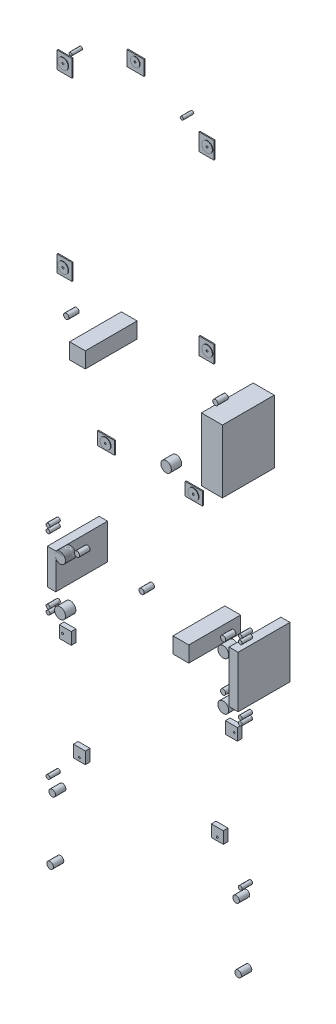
from build123d import *

# Parameters (mm, degrees)
ESQUISSE2_R                = 52.520227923
A_B_C_DEPTH                = 100
A_B_C_2_DEPTH              = 100
A_B_C_3_DEPTH              = 100
A_B_C_4_DEPTH              = 100
ESQUISSE2_R_2              = 31.747741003
A_B_C_5_DEPTH              = 100
A_B_C_6_DEPTH              = 100
A_B_C_7_DEPTH              = 100
A_B_C_8_DEPTH              = 100
ESQUISSE2_R_3              = 25.398192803
A_B_C_9_DEPTH              = 100
A_B_C_10_DEPTH             = 100
A_B_C_11_DEPTH             = 100
A_B_C_12_DEPTH             = 100
ESQUISSE2_W                = 114.991827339
ESQUISSE2_H                = 114.991827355
A_B_C_13_DEPTH             = 100
ESQUISSE2_W_2              = 114.991827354
ESQUISSE2_H_2              = 114.051773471
A_B_C_14_DEPTH             = 100
ESQUISSE2_H_3              = 114.991827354
A_B_C_15_DEPTH             = 100
A_B_C_16_DEPTH             = 100
ESQUISSE3_R                = 18.887018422
EXTRUDE_D_DEPTH            = 100
EXTRUDE_D_2_DEPTH          = 100
EXTRUDE_D_3_DEPTH          = 100
EXTRUDE_D_4_DEPTH          = 100
EXTRUDE_D_5_DEPTH          = 100
EXTRUDE_D_6_DEPTH          = 100
EXTRUDE_D_7_DEPTH          = 100
EXTRUDE_D_8_DEPTH          = 100
EXTRUDE_D_9_DEPTH          = 100
EXTRUDE_D_10_DEPTH         = 100
ESQUISSE4_R                = 50.796385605
BOSS_EXTRU_3_DEPTH         = 100
BOSS_EXTRU_3_2_DEPTH       = 100
BOSS_EXTRU_3_3_DEPTH       = 100
BOSS_EXTRU_3_4_DEPTH       = 100
BOSS_EXTRU_3_5_DEPTH       = 100
BOSS_EXTRU_3_6_DEPTH       = 100
BOSS_EXTRU_3_7_DEPTH       = 100
ESQUISSE4_R_2              = 25.398192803
BOSS_EXTRU_3_8_DEPTH       = 100
BOSS_EXTRU_3_9_DEPTH       = 100
ESQUISSE4_R_3              = 15.238915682
BOSS_EXTRU_3_10_DEPTH      = 100
BOSS_EXTRU_3_11_DEPTH      = 100
ESQUISSE4_R_4              = 44.192855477
BOSS_EXTRU_3_12_DEPTH      = 100
ESQUISSE5_W                = 87.166241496
ESQUISSE5_H                = 497.485958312
ESQUISSE5_W_2              = 152.389156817
ESQUISSE5_H_2              = 152.389348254
ESQUISSE5_W_3              = 81.375767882
ESQUISSE5_H_3              = 341.064857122
ESQUISSE5_W_4              = 203.185542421
ESQUISSE5_H_4              = 609.556627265
ESQUISSE5_W_5              = 151.810565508
ESQUISSE5_H_5              = 151.810565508
BOSS_EXTRU_4_DEPTH         = 500
ESQUISSE6_W                = 1904.864431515
ESQUISSE6_H                = 2919.792319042
BOSS_EXTRU_5_DEPTH         = 2000
ESQUISSE6_W_2              = 1225.71678466
ESQUISSE6_H_2              = 2212.817547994
BOSS_EXTRU_5_2_DEPTH       = 2000
ESQUISSE6_W_3              = 1656.343343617
ESQUISSE6_H_3              = 966.772209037
BOSS_EXTRU_5_3_DEPTH       = 2000
ESQUISSE7_W                = 142.864834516
ESQUISSE7_H                = 165.088253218
ESQUISSE7_R                = 50.796385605
BOSS_EXTRU_6_DEPTH         = 10
ESQUISSE7_W_2              = 142.864834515
BOSS_EXTRU_6_2_DEPTH       = 10
ESQUISSE7_W_3              = 165.088253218
ESQUISSE7_H_2              = 142.864834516
ESQUISSE7_R_2              = 44.192855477
BOSS_EXTRU_6_3_DEPTH       = 10
BOSS_EXTRU_6_4_DEPTH       = 10
ESQUISSE7_H_3              = 158.738705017
BOSS_EXTRU_6_5_DEPTH       = 10
ESQUISSE7_W_4              = 165.088253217
ESQUISSE7_H_4              = 123.816240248
BOSS_EXTRU_6_6_DEPTH       = 10
BOSS_EXTRU_6_7_DEPTH       = 10
ESQUISSE8_R                = 50.796385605
ESQUISSE8_R_2              = 44.192855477
ENL_V_MAT_EXTRU_1_DEPTH    = 85
D_GAGEMENT_M161_AT_2_COUNT = 2
D_GAGEMENT_M161_AT_2_PITCH = 848.299639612
D_GAGEMENT_M161_AT_3_COUNT = 2
D_GAGEMENT_M161_AT_3_PITCH = 1328.031486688
D_GAGEMENT_M161_AT_4_COUNT = 2
D_GAGEMENT_M161_AT_4_PITCH = 1600.312306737
D_GAGEMENT_M161_AT_5_COUNT = 2
D_GAGEMENT_M161_AT_5_PITCH = 3126.642890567
D_GAGEMENT_M161_AT_6_COUNT = 2
D_GAGEMENT_M161_AT_6_PITCH = 3342.651071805
D_GAGEMENT_M161_AT_7_COUNT = 2
D_GAGEMENT_M161_AT_7_PITCH = 2996.425189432
ESQUISSE11_W               = 54.709029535
ESQUISSE11_H               = 1140.180950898
ENL_V_MAT_EXTRU_2_DEPTH    = 69022.726003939
ESQUISSE13_W               = 9
ESQUISSE13_H               = 445.290970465
D_GAGEMENT_M162_AT_2_COUNT = 2
D_GAGEMENT_M162_AT_2_PITCH = 1656.638800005
D_GAGEMENT_M162_AT_3_COUNT = 2
D_GAGEMENT_M162_AT_3_PITCH = 1774.30579041
D_GAGEMENT_M162_AT_4_COUNT = 2
D_GAGEMENT_M162_AT_4_PITCH = 970.729277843
ESQUISSE14_R               = 52.520227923
BOSS_EXTRU_7_DEPTH         = 100


with BuildPart() as part:
    # Esquisse2 → a-b-c (new body)
    with BuildSketch(Plane.XY):
        with Locations((32095.371211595, 64025.247249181)):
            Circle(ESQUISSE2_R)
    extrude(amount=-A_B_C_DEPTH)


with BuildPart() as body_2:
    # Esquisse2 → a-b-c 2 (new body)
    with BuildSketch(Plane.XY):
        with Locations((32095.371211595, 64488.510285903)):
            Circle(ESQUISSE2_R)
    extrude(amount=-A_B_C_2_DEPTH)


with BuildPart() as body_3:
    # Esquisse2 → a-b-c 3 (new body)
    with BuildSketch(Plane.XY):
        with Locations((30520.683215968, 64487.995774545)):
            Circle(ESQUISSE2_R)
    extrude(amount=-A_B_C_3_DEPTH)

    # Esquisse5 → Boss.-Extru.4 (add)
    with BuildSketch(Plane.XY):
        with Locations((32195.303488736, 64308.074603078)):
            Rectangle(ESQUISSE5_W, ESQUISSE5_H)
        with Locations((31686.573008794, 64303.822582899)):
            Rectangle(ESQUISSE5_W_2, ESQUISSE5_H_2)
        with Locations((30438.71352094, 64352.316214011)):
            Rectangle(ESQUISSE5_W_3, ESQUISSE5_H_3)
        with Locations((31986.029536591, 66075.057217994)):
            Rectangle(ESQUISSE5_W_4, ESQUISSE5_H_4)
        with Locations((30688.555630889, 66262.431988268)):
            Rectangle(ESQUISSE5_W_5, ESQUISSE5_H_5)
    extrude(amount=-BOSS_EXTRU_4_DEPTH)


with BuildPart() as body_4:
    # Esquisse2 → a-b-c 4 (new body)
    with BuildSketch(Plane.XY):
        with Locations((30520.683215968, 64025.106415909)):
            Circle(ESQUISSE2_R)
    extrude(amount=-A_B_C_4_DEPTH)


with BuildPart() as body_5:
    # Esquisse2 → a-b-c 5 (new body)
    with BuildSketch(Plane.XY):
        with Locations((32239.044655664, 61870.558041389)):
            Circle(ESQUISSE2_R_2)
    extrude(amount=-A_B_C_5_DEPTH)


with BuildPart() as body_6:
    # Esquisse2 → a-b-c 6 (new body)
    with BuildSketch(Plane.XY):
        with Locations((32219.041079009, 62483.614419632)):
            Circle(ESQUISSE2_R_2)
    extrude(amount=-A_B_C_6_DEPTH)


with BuildPart() as body_7:
    # Esquisse2 → a-b-c 7 (new body)
    with BuildSketch(Plane.XY):
        with Locations((30444.977311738, 62483.614419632)):
            Circle(ESQUISSE2_R_2)
    extrude(amount=-A_B_C_7_DEPTH)


with BuildPart() as body_8:
    # Esquisse2 → a-b-c 8 (new body)
    with BuildSketch(Plane.XY):
        with Locations((30424.978734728, 61870.558041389)):
            Circle(ESQUISSE2_R_2)
    extrude(amount=-A_B_C_8_DEPTH)


with BuildPart() as body_9:
    # Esquisse2 → a-b-c 9 (new body)
    with BuildSketch(Plane.XY):
        with Locations((30684.543072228, 64599.657659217)):
            Circle(ESQUISSE2_R_3)
    extrude(amount=-A_B_C_9_DEPTH)


with BuildPart() as body_10:
    # Esquisse2 → a-b-c 10 (new body)
    with BuildSketch(Plane.XY):
        with Locations((31306.798792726, 64599.657659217)):
            Circle(ESQUISSE2_R_3)
    extrude(amount=-A_B_C_10_DEPTH)


with BuildPart() as body_11:
    # Esquisse2 → a-b-c 11 (new body)
    with BuildSketch(Plane.XY):
        with Locations((32094.142765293, 64599.657659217)):
            Circle(ESQUISSE2_R_3)
    extrude(amount=-A_B_C_11_DEPTH)


with BuildPart() as body_12:
    # Esquisse2 → a-b-c 12 (new body)
    with BuildSketch(Plane.XY):
        with Locations((32094.142765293, 64152.649465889)):
            Circle(ESQUISSE2_R_3)
    extrude(amount=-A_B_C_12_DEPTH)


with BuildPart() as body_13:
    # Esquisse2 → a-b-c 13 (new body)
    with BuildSketch(Plane.XY):
        with Locations((32119.210545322, 63812.294969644)):
            Rectangle(ESQUISSE2_W, ESQUISSE2_H)
    extrude(amount=-A_B_C_13_DEPTH)


with BuildPart() as body_14:
    # Esquisse2 → a-b-c 14 (new body)
    with BuildSketch(Plane.XY):
        with Locations((31983.544869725, 62882.010720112)):
            Rectangle(ESQUISSE2_W_2, ESQUISSE2_H_2)
    extrude(amount=-A_B_C_14_DEPTH)


with BuildPart() as body_15:
    # Esquisse2 → a-b-c 15 (new body)
    with BuildSketch(Plane.XY):
        with Locations((30652.351449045, 62882.339913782)):
            Rectangle(ESQUISSE2_W_2, ESQUISSE2_H_3)
    extrude(amount=-A_B_C_15_DEPTH)


with BuildPart() as body_16:
    # Esquisse2 → a-b-c 16 (new body)
    with BuildSketch(Plane.XY):
        with Locations((30516.685731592, 63812.294969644)):
            Rectangle(ESQUISSE2_W, ESQUISSE2_H)
    extrude(amount=-A_B_C_16_DEPTH)


with BuildPart() as body_17:
    # Esquisse3 → Extrude d (new body)
    with BuildSketch(Plane.XY):
        with Locations((32259.44820394, 64649.960274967)):
            Circle(ESQUISSE3_R)
    extrude(amount=-EXTRUDE_D_DEPTH)


with BuildPart() as body_18:
    # Esquisse3 → Extrude d 2 (new body)
    with BuildSketch(Plane.XY):
        with Locations((32259.44820439, 64699.956719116)):
            Circle(ESQUISSE3_R)
    extrude(amount=-EXTRUDE_D_2_DEPTH)


with BuildPart() as body_19:
    # Esquisse3 → Extrude d 3 (new body)
    with BuildSketch(Plane.XY):
        with Locations((30404.580098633, 64699.956718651)):
            Circle(ESQUISSE3_R)
    extrude(amount=-EXTRUDE_D_3_DEPTH)


with BuildPart() as body_20:
    # Esquisse3 → Extrude d 4 (new body)
    with BuildSketch(Plane.XY):
        with Locations((30404.58018626, 64649.960274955)):
            Circle(ESQUISSE3_R)
    extrude(amount=-EXTRUDE_D_4_DEPTH)


with BuildPart() as body_21:
    # Esquisse3 → Extrude d 5 (new body)
    with BuildSketch(Plane.XY):
        with Locations((30404.58018626, 64020.005099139)):
            Circle(ESQUISSE3_R)
    extrude(amount=-EXTRUDE_D_5_DEPTH)


with BuildPart() as body_22:
    # Esquisse3 → Extrude d 6 (new body)
    with BuildSketch(Plane.XY):
        with Locations((30404.58018626, 63970.008656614)):
            Circle(ESQUISSE3_R)
    extrude(amount=-EXTRUDE_D_6_DEPTH)


with BuildPart() as body_23:
    # Esquisse3 → Extrude d 7 (new body)
    with BuildSketch(Plane.XY):
        with Locations((32259.44820394, 64020.005099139)):
            Circle(ESQUISSE3_R)
    extrude(amount=-EXTRUDE_D_7_DEPTH)


with BuildPart() as body_24:
    # Esquisse3 → Extrude d 8 (new body)
    with BuildSketch(Plane.XY):
        with Locations((32259.44820394, 63970.008656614)):
            Circle(ESQUISSE3_R)
    extrude(amount=-EXTRUDE_D_8_DEPTH)


with BuildPart() as body_25:
    # Esquisse3 → Extrude d 9 (new body)
    with BuildSketch(Plane.XY):
        with Locations((32259.44820394, 62597.606309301)):
            Circle(ESQUISSE3_R)
    extrude(amount=-EXTRUDE_D_9_DEPTH)


with BuildPart() as body_26:
    # Esquisse3 → Extrude d 10 (new body)
    with BuildSketch(Plane.XY):
        with Locations((30404.58018626, 62597.606309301)):
            Circle(ESQUISSE3_R)
    extrude(amount=-EXTRUDE_D_10_DEPTH)


with BuildPart() as body_27:
    # Esquisse4 → Boss.-Extru.3 (new body)
    with BuildSketch(Plane.XY):
        with Locations((30872.340726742, 65575.783477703)):
            Circle(ESQUISSE4_R)
    extrude(amount=-BOSS_EXTRU_3_DEPTH)


with BuildPart() as body_28:
    # Esquisse4 → Boss.-Extru.3 2 (new body)
    with BuildSketch(Plane.XY):
        with Locations((31720.640366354, 65575.783477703)):
            Circle(ESQUISSE4_R)
    extrude(amount=-BOSS_EXTRU_3_2_DEPTH)


with BuildPart() as body_29:
    # Esquisse4 → Boss.-Extru.3 3 (new body)
    with BuildSketch(Plane.XY):
        with Locations((31543.259387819, 65759.920375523)):
            Circle(ESQUISSE4_R)
    extrude(amount=-BOSS_EXTRU_3_3_DEPTH)


with BuildPart() as body_30:
    # Esquisse4 → Boss.-Extru.3 4 (new body)
    with BuildSketch(Plane.XY):
        with Locations((30463.582211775, 66839.343569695)):
            Circle(ESQUISSE4_R)
    extrude(amount=-BOSS_EXTRU_3_4_DEPTH)


with BuildPart() as body_31:
    # Esquisse4 → Boss.-Extru.3 5 (new body)
    with BuildSketch(Plane.XY):
        with Locations((31854.387249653, 66839.343569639)):
            Circle(ESQUISSE4_R)
    extrude(amount=-BOSS_EXTRU_3_5_DEPTH)


with BuildPart() as body_32:
    # Esquisse4 → Boss.-Extru.3 6 (new body)
    with BuildSketch(Plane.XY):
        with Locations((30463.582211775, 68544.197261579)):
            Circle(ESQUISSE4_R)
    extrude(amount=-BOSS_EXTRU_3_6_DEPTH)


with BuildPart() as body_33:
    # Esquisse4 → Boss.-Extru.3 7 (new body)
    with BuildSketch(Plane.XY):
        with Locations((31854.387249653, 68544.197261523)):
            Circle(ESQUISSE4_R)
    extrude(amount=-BOSS_EXTRU_3_7_DEPTH)


with BuildPart() as body_34:
    # Esquisse4 → Boss.-Extru.3 8 (new body)
    with BuildSketch(Plane.XY):
        with Locations((32019.069131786, 66534.565256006)):
            Circle(ESQUISSE4_R_2)
    extrude(amount=-BOSS_EXTRU_3_8_DEPTH)


with BuildPart() as body_35:
    # Esquisse4 → Boss.-Extru.3 9 (new body)
    with BuildSketch(Plane.XY):
        with Locations((30580.261509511, 66534.565256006)):
            Circle(ESQUISSE4_R_2)
    extrude(amount=-BOSS_EXTRU_3_9_DEPTH)


with BuildPart() as body_36:
    # Esquisse4 → Boss.-Extru.3 10 (new body)
    with BuildSketch(Plane.XY):
        with Locations((31695.648544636, 68747.382804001)):
            Circle(ESQUISSE4_R_3)
    extrude(amount=-BOSS_EXTRU_3_10_DEPTH)


with BuildPart() as body_37:
    # Esquisse4 → Boss.-Extru.3 11 (new body)
    with BuildSketch(Plane.XY):
        with Locations((30622.320916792, 68747.382804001)):
            Circle(ESQUISSE4_R_3)
    extrude(amount=-BOSS_EXTRU_3_11_DEPTH)


with BuildPart() as body_38:
    # Esquisse4 → Boss.-Extru.3 12 (new body)
    with BuildSketch(Plane.XY):
        with Locations((31158.984730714, 68906.121509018)):
            Circle(ESQUISSE4_R_4)
    extrude(amount=-BOSS_EXTRU_3_12_DEPTH)


with BuildPart() as boss_extru_4_piece_1:
    # of the separate pieces the step leaves, piece 1, a body of its own (boss_extru_4_pieces)
    add(body_3.part.solids().sort_by_distance((31884.43676538, 66379.835531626, 0))[0])


with BuildPart() as boss_extru_4_piece_2:
    # of the separate pieces the step leaves, piece 2, a body of its own (boss_extru_4_pieces)
    add(body_3.part.solids().sort_by_distance((32151.720367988, 64556.817582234, 0))[0])


with BuildPart() as boss_extru_4_piece_3:
    # of the separate pieces the step leaves, piece 3, a body of its own (boss_extru_4_pieces)
    add(body_3.part.solids().sort_by_distance((30479.401404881, 64520.464011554, 0))[0])


with BuildPart() as boss_extru_4_piece_4:
    # of the separate pieces the step leaves, piece 4, a body of its own (boss_extru_4_pieces)
    add(body_3.part.solids().sort_by_distance((31762.767587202, 64227.627908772, 0))[0])


with BuildPart() as boss_extru_4_piece_5:
    # of the separate pieces the step leaves, piece 5, a body of its own (boss_extru_4_pieces)
    add(body_3.part.solids().sort_by_distance((30612.650348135, 66338.337271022, 0))[0])


with BuildPart() as body_43:
    # Esquisse6 → Boss.-Extru.5 (new body)
    with BuildSketch(Plane.XY):
        with Locations((31332.014180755, 63265.058854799)):
            Rectangle(ESQUISSE6_W, ESQUISSE6_H)
    extrude(amount=BOSS_EXTRU_5_DEPTH)


with BuildPart() as body_44:
    # Esquisse6 → Boss.-Extru.5 2 (new body)
    with BuildSketch(Plane.XY):
        with Locations((31158.984730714, 67717.168608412)):
            Rectangle(ESQUISSE6_W_2, ESQUISSE6_H_2)
    extrude(amount=BOSS_EXTRU_5_2_DEPTH)


with BuildPart() as body_45:
    # Esquisse6 → Boss.-Extru.5 3 (new body)
    with BuildSketch(Plane.XY):
        with Locations((31311.538875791, 66127.363729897)):
            Rectangle(ESQUISSE6_W_3, ESQUISSE6_H_3)
    extrude(amount=BOSS_EXTRU_5_3_DEPTH)


with BuildPart() as body_46:
    # Esquisse7 → Boss.-Extru.6 (new body)
    with BuildSketch(Plane(origin=(0, 0, -100), x_dir=(-1, 0, 0), z_dir=(0, 0, -1))):
        with Locations((-30474.693921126, 68544.197261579)):
            Rectangle(ESQUISSE7_W, ESQUISSE7_H)
        with Locations((-30463.582211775, 68544.197261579)):
            Circle(ESQUISSE7_R, mode=Mode.SUBTRACT)
    extrude(amount=-BOSS_EXTRU_6_DEPTH)


with BuildPart() as body_47:
    # Esquisse7 → Boss.-Extru.6 2 (new body)
    with BuildSketch(Plane(origin=(0, 0, -100), x_dir=(-1, 0, 0), z_dir=(0, 0, -1))):
        with Locations((-31843.275540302, 68544.197261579)):
            Rectangle(ESQUISSE7_W_2, ESQUISSE7_H)
        with Locations((-31854.387249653, 68544.197261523)):
            Circle(ESQUISSE7_R, mode=Mode.SUBTRACT)
    extrude(amount=-BOSS_EXTRU_6_2_DEPTH)


with BuildPart() as body_48:
    # Esquisse7 → Boss.-Extru.6 3 (new body)
    with BuildSketch(Plane(origin=(0, 0, -100), x_dir=(-1, 0, 0), z_dir=(0, 0, -1))):
        with Locations((-31158.984730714, 68895.009799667)):
            Rectangle(ESQUISSE7_W_3, ESQUISSE7_H_2)
        with Locations((-31158.984730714, 68906.121509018)):
            Circle(ESQUISSE7_R_2, mode=Mode.SUBTRACT)
    extrude(amount=-BOSS_EXTRU_6_3_DEPTH)


with BuildPart() as body_49:
    # Esquisse7 → Boss.-Extru.6 4 (new body)
    with BuildSketch(Plane(origin=(0, 0, -100), x_dir=(-1, 0, 0), z_dir=(0, 0, -1))):
        with Locations((-31843.275540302, 66839.343569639)):
            Rectangle(ESQUISSE7_W_2, ESQUISSE7_H)
        with Locations((-31854.387249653, 66839.343569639)):
            Circle(ESQUISSE7_R, mode=Mode.SUBTRACT)
    extrude(amount=-BOSS_EXTRU_6_4_DEPTH)


with BuildPart() as body_50:
    # Esquisse7 → Boss.-Extru.6 5 (new body)
    with BuildSketch(Plane(origin=(0, 0, -100), x_dir=(-1, 0, 0), z_dir=(0, 0, -1))):
        with Locations((-30474.693921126, 66842.518343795)):
            Rectangle(ESQUISSE7_W, ESQUISSE7_H_3)
        with Locations((-30463.582211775, 66839.343569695)):
            Circle(ESQUISSE7_R, mode=Mode.SUBTRACT)
    extrude(amount=-BOSS_EXTRU_6_5_DEPTH)


with BuildPart() as body_51:
    # Esquisse7 → Boss.-Extru.6 6 (new body)
    with BuildSketch(Plane(origin=(0, 0, -100), x_dir=(-1, 0, 0), z_dir=(0, 0, -1))):
        with Locations((-31720.640366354, 65577.37088992)):
            Rectangle(ESQUISSE7_W_4, ESQUISSE7_H_4)
        with Locations((-31720.640366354, 65575.783477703)):
            Circle(ESQUISSE7_R, mode=Mode.SUBTRACT)
    extrude(amount=-BOSS_EXTRU_6_6_DEPTH)


with BuildPart() as body_52:
    # Esquisse7 → Boss.-Extru.6 7 (new body)
    with BuildSketch(Plane(origin=(0, 0, -100), x_dir=(-1, 0, 0), z_dir=(0, 0, -1))):
        with Locations((-30872.340726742, 65577.37088992)):
            Rectangle(ESQUISSE7_W_3, ESQUISSE7_H_4)
        with Locations((-30872.340726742, 65575.783477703)):
            Circle(ESQUISSE7_R, mode=Mode.SUBTRACT)
    extrude(amount=-BOSS_EXTRU_6_7_DEPTH)


with BuildPart() as enl_v_mat_extru_1_tool:
    # Esquisse8 → Enl_v. mat.-Extru.1 (new body)
    with BuildSketch(Plane.XY):
        with Locations(Location((31854.387249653, 68544.197261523, 0), (0, 0, 180))):
            Circle(ESQUISSE8_R)
        with Locations(Location((30463.582211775, 68544.197261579, 0), (0, 0, 180))):
            Circle(ESQUISSE8_R)
        with Locations(Location((31158.984730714, 68906.121509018, 0), (0, 0, 180))):
            Circle(ESQUISSE8_R_2)
        with Locations(Location((30872.340726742, 65575.783477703, 0), (0, 0, 180))):
            Circle(ESQUISSE8_R)
        with Locations(Location((31720.640366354, 65575.783477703, 0), (0, 0, 180))):
            Circle(ESQUISSE8_R)
        with Locations(Location((31854.387249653, 66839.343569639, 0), (0, 0, 180))):
            Circle(ESQUISSE8_R)
        with Locations(Location((30463.582211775, 66839.343569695, 0), (0, 0, 180))):
            Circle(ESQUISSE8_R)
    extrude(amount=-ENL_V_MAT_EXTRU_1_DEPTH)


with BuildPart() as body_27_1:
    add(body_27.part)

    # Enl_v. mat.-Extru.1: cut by enl_v_mat_extru_1_tool
    add(enl_v_mat_extru_1_tool.part, mode=Mode.SUBTRACT)

    # Esquisse10 → D_gagement M161 (revolve, cut)
    with BuildSketch(Plane(origin=(30872.340726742, 65575.783477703, -85), x_dir=(0, -1, 0), z_dir=(1, 0, 0))):
        Polygon((0, 0), (0, 38.157745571), (9, 32.75), (9, 0), align=None)
    d_gagement_m161 = revolve(axis=Axis((30872.340726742, 65575.783477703, -78.65), (0, 0, -1)), mode=Mode.SUBTRACT)


with BuildPart() as body_28_1:
    add(body_28.part)

    # Enl_v. mat.-Extru.1: cut by enl_v_mat_extru_1_tool
    add(enl_v_mat_extru_1_tool.part, mode=Mode.SUBTRACT)

    # D_gagement M161 at 2: D_gagement M161 ×2
    with Locations(*[(i * D_GAGEMENT_M161_AT_2_PITCH, 0, 0) for i in range(1, D_GAGEMENT_M161_AT_2_COUNT)]):
        add(d_gagement_m161, mode=Mode.SUBTRACT)


with BuildPart() as body_30_1:
    add(body_30.part)

    # Enl_v. mat.-Extru.1: cut by enl_v_mat_extru_1_tool
    add(enl_v_mat_extru_1_tool.part, mode=Mode.SUBTRACT)

    # D_gagement M161 at 3: D_gagement M161 ×2
    with Locations(*[Vector(-0.3077927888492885, 0.9514534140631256, 0) * (i * D_GAGEMENT_M161_AT_3_PITCH) for i in range(1, D_GAGEMENT_M161_AT_3_COUNT)]):
        add(d_gagement_m161, mode=Mode.SUBTRACT)


with BuildPart() as body_31_1:
    add(body_31.part)

    # Enl_v. mat.-Extru.1: cut by enl_v_mat_extru_1_tool
    add(enl_v_mat_extru_1_tool.part, mode=Mode.SUBTRACT)

    # D_gagement M161 at 4: D_gagement M161 ×2
    with Locations(*[Vector(0.6136592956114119, 0.789570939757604, 0) * (i * D_GAGEMENT_M161_AT_4_PITCH) for i in range(1, D_GAGEMENT_M161_AT_4_COUNT)]):
        add(d_gagement_m161, mode=Mode.SUBTRACT)


with BuildPart() as body_32_1:
    add(body_32.part)

    # Enl_v. mat.-Extru.1: cut by enl_v_mat_extru_1_tool
    add(enl_v_mat_extru_1_tool.part, mode=Mode.SUBTRACT)

    # D_gagement M161 at 7: D_gagement M161 ×2
    with Locations(*[Vector(-0.13641539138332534, 0.9906517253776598, 0) * (i * D_GAGEMENT_M161_AT_7_PITCH) for i in range(1, D_GAGEMENT_M161_AT_7_COUNT)]):
        add(d_gagement_m161, mode=Mode.SUBTRACT)


with BuildPart() as body_33_1:
    add(body_33.part)

    # Enl_v. mat.-Extru.1: cut by enl_v_mat_extru_1_tool
    add(enl_v_mat_extru_1_tool.part, mode=Mode.SUBTRACT)

    # D_gagement M161 at 5: D_gagement M161 ×2
    with Locations(*[Vector(0.3140897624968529, 0.9493932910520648, 0) * (i * D_GAGEMENT_M161_AT_5_PITCH) for i in range(1, D_GAGEMENT_M161_AT_5_COUNT)]):
        add(d_gagement_m161, mode=Mode.SUBTRACT)


with BuildPart() as body_38_1:
    add(body_38.part)

    # Enl_v. mat.-Extru.1: cut by enl_v_mat_extru_1_tool
    add(enl_v_mat_extru_1_tool.part, mode=Mode.SUBTRACT)

    # D_gagement M161 at 6: D_gagement M161 ×2
    with Locations(*[Vector(0.08575349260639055, 0.9963163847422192, 0) * (i * D_GAGEMENT_M161_AT_6_PITCH) for i in range(1, D_GAGEMENT_M161_AT_6_COUNT)]):
        add(d_gagement_m161, mode=Mode.SUBTRACT)


with BuildPart() as enl_v_mat_extru_2_tool:
    # Esquisse11 → Enl_v. mat.-Extru.2 (new, through all)
    with BuildSketch(Plane.ZY.offset(-30379.581964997)):
        with Locations((-27.354514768, 63341.611439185)):
            Rectangle(ESQUISSE11_W, ESQUISSE11_H)
    extrude(amount=-ENL_V_MAT_EXTRU_2_DEPTH)


with BuildPart() as body_13_1:
    add(body_13.part)

    # Enl_v. mat.-Extru.2: cut by enl_v_mat_extru_2_tool
    add(enl_v_mat_extru_2_tool.part, mode=Mode.SUBTRACT)

    # Esquisse13 → D_gagement M162 (revolve, cut)
    with BuildSketch(Plane(origin=(32146.331077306, 63812.433121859, -54.709029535), x_dir=(0, -1, 0), z_dir=(1, 0, 0))):
        with Locations((4.5, 222.645485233)):
            Rectangle(ESQUISSE13_W, ESQUISSE13_H)
    d_gagement_m162 = revolve(axis=Axis((32146.331077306, 63812.433121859, -48.359029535), (0, 0, -1)), mode=Mode.SUBTRACT)


with BuildPart() as body_14_1:
    add(body_14.part)

    # Enl_v. mat.-Extru.2: cut by enl_v_mat_extru_2_tool
    add(enl_v_mat_extru_2_tool.part, mode=Mode.SUBTRACT)

    # D_gagement M162 at 4: D_gagement M162 ×2
    with Locations(*[Vector(-0.16746172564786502, -0.985878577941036, 0) * (i * D_GAGEMENT_M162_AT_4_PITCH) for i in range(1, D_GAGEMENT_M162_AT_4_COUNT)]):
        add(d_gagement_m162, mode=Mode.SUBTRACT)


with BuildPart() as body_15_1:
    add(body_15.part)

    # Enl_v. mat.-Extru.2: cut by enl_v_mat_extru_2_tool
    add(enl_v_mat_extru_2_tool.part, mode=Mode.SUBTRACT)

    # D_gagement M162 at 3: D_gagement M162 ×2
    with Locations(*[Vector(-0.842063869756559, -0.5393778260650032, 0) * (i * D_GAGEMENT_M162_AT_3_PITCH) for i in range(1, D_GAGEMENT_M162_AT_3_COUNT)]):
        add(d_gagement_m162, mode=Mode.SUBTRACT)


with BuildPart() as body_16_1:
    add(body_16.part)

    # Enl_v. mat.-Extru.2: cut by enl_v_mat_extru_2_tool
    add(enl_v_mat_extru_2_tool.part, mode=Mode.SUBTRACT)

    # D_gagement M162 at 2: D_gagement M162 ×2
    with Locations(*[(-i * D_GAGEMENT_M162_AT_2_PITCH, 0, 0) for i in range(1, D_GAGEMENT_M162_AT_2_COUNT)]):
        add(d_gagement_m162, mode=Mode.SUBTRACT)


with BuildPart() as body_53:
    # Esquisse14 → Boss.-Extru.7 (new body)
    with BuildSketch(Plane(origin=(0, 0, 0), x_dir=(-1, 0, 0), z_dir=(0, 0, -1))):
        with Locations(Location((-30520.683215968, 64487.995774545, 0), (0, 0, 180))):
            Circle(ESQUISSE14_R)
    extrude(amount=BOSS_EXTRU_7_DEPTH)


solid = Compound([part.part, body_2.part, body_4.part, body_5.part, body_6.part, body_7.part, body_8.part, body_9.part, body_10.part, body_11.part, body_12.part, body_17.part, body_18.part, body_19.part, body_20.part, body_21.part, body_22.part, body_23.part, body_24.part, body_25.part, body_26.part, body_29.part, body_34.part, body_35.part, body_36.part, body_37.part, boss_extru_4_piece_1.part, boss_extru_4_piece_2.part, boss_extru_4_piece_3.part, boss_extru_4_piece_4.part, boss_extru_4_piece_5.part, body_46.part, body_47.part, body_48.part, body_49.part, body_50.part, body_51.part, body_52.part, body_27_1.part, body_28_1.part, body_30_1.part, body_31_1.part, body_32_1.part, body_33_1.part, body_38_1.part, body_13_1.part, body_14_1.part, body_15_1.part, body_16_1.part, body_53.part])
